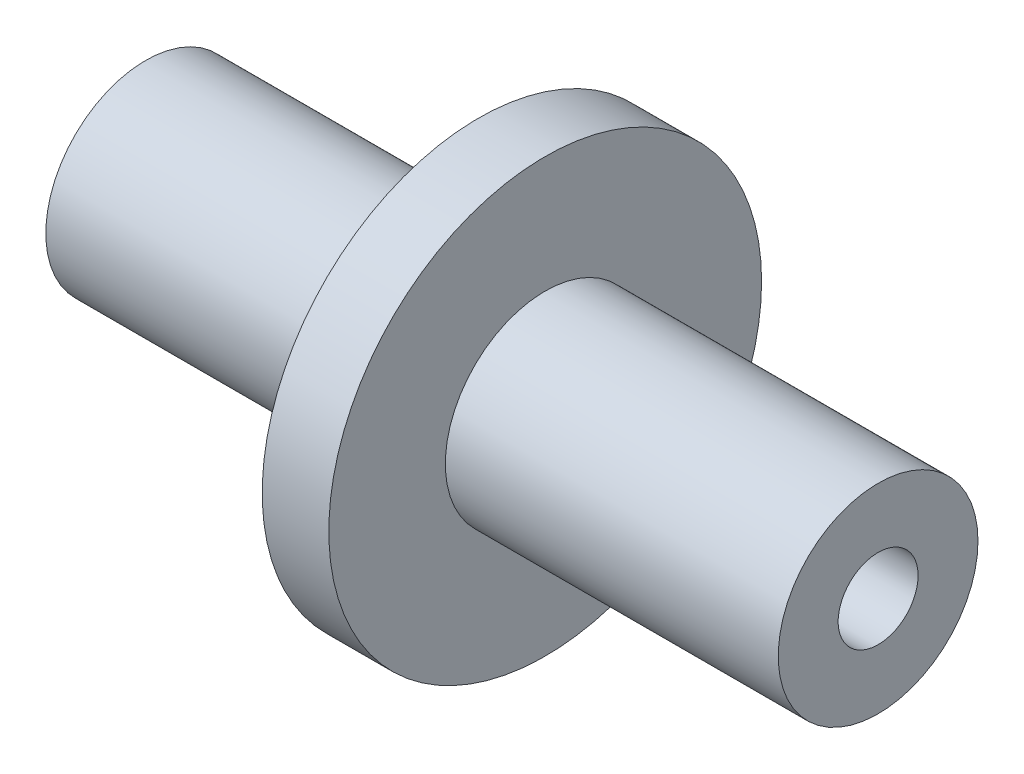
from build123d import *


with BuildPart() as part:
    # Esquisse2 → R_volution1 (revolve)
    with BuildSketch(Plane(origin=(0, 0, 0), x_dir=(1, 0, 0), z_dir=(0, 1, 0))):
        Polygon((-5, -2.25), (-10, -2.25), (-10, -0.5), (-11, -0.5), (-11, -2.25), (-16, -2.25), (-16, -3.15), (-5, -3.15), align=None)
    revolve(axis=Axis((4.600783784, 0, 3.75), (-1, 0, 0)))


solid = part.part
